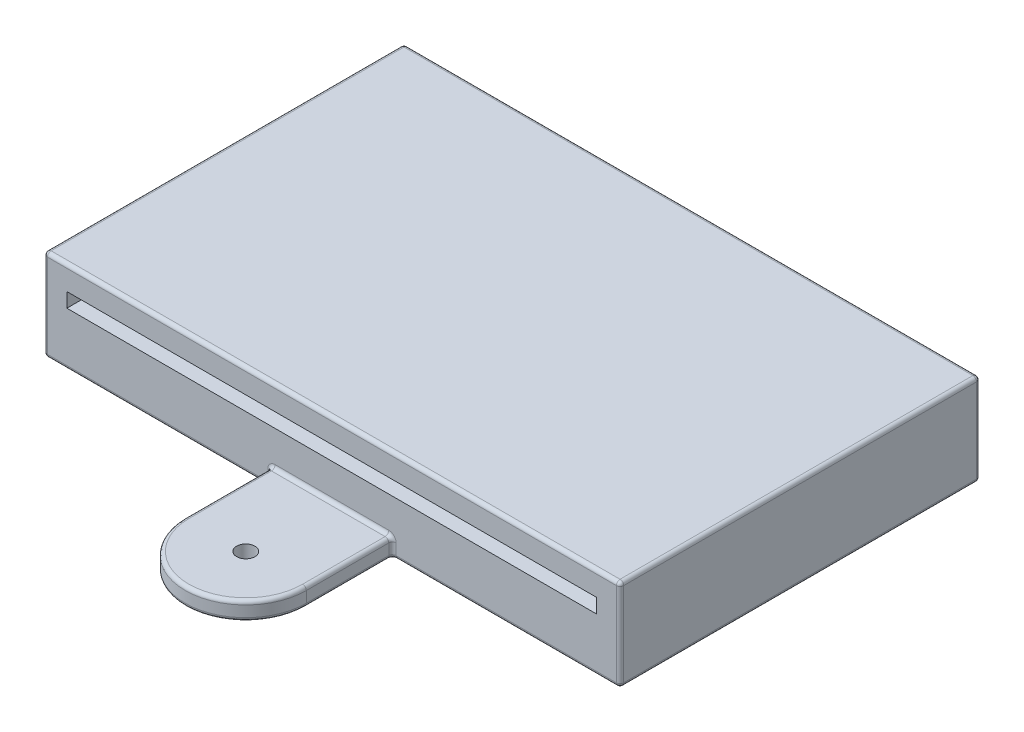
ISO-10303-21;
HEADER;
FILE_DESCRIPTION(('STEP AP214'),'2;1');
FILE_NAME('part.step','',(''),(''),'','','');
FILE_SCHEMA(('AUTOMOTIVE_DESIGN { 1 0 10303 214 1 1 1 1 }'));
ENDSEC;
DATA;
#1=APPLICATION_CONTEXT('core data for automotive mechanical design processes');
#2=APPLICATION_PROTOCOL_DEFINITION('international standard','automotive_design',2000,#1);
#3=PRODUCT_CONTEXT('',#1,'mechanical');
#4=PRODUCT('Part','Part','',(#3));
#5=PRODUCT_RELATED_PRODUCT_CATEGORY('part','',(#4));
#6=PRODUCT_DEFINITION_FORMATION('','',#4);
#7=PRODUCT_DEFINITION_CONTEXT('part definition',#1,'design');
#8=PRODUCT_DEFINITION('design','',#6,#7);
#9=PRODUCT_DEFINITION_SHAPE('','',#8);
#10=(LENGTH_UNIT() NAMED_UNIT(*) SI_UNIT(.MILLI.,.METRE.));
#11=(NAMED_UNIT(*) PLANE_ANGLE_UNIT() SI_UNIT($,.RADIAN.));
#12=(NAMED_UNIT(*) SI_UNIT($,.STERADIAN.) SOLID_ANGLE_UNIT());
#13=UNCERTAINTY_MEASURE_WITH_UNIT(LENGTH_MEASURE(1.E-05),#10,'distance_accuracy_value','');
#14=(GEOMETRIC_REPRESENTATION_CONTEXT(3) GLOBAL_UNCERTAINTY_ASSIGNED_CONTEXT((#13)) GLOBAL_UNIT_ASSIGNED_CONTEXT((#10,
#11,#12)) REPRESENTATION_CONTEXT('',''));
#15=CARTESIAN_POINT('',(0.,0.,0.));
#16=DIRECTION('',(0.,0.,1.));
#17=DIRECTION('',(1.,0.,0.));
#18=AXIS2_PLACEMENT_3D('',#15,#16,#17);
#19=CARTESIAN_POINT('',(-400.,127.,250.));
#20=DIRECTION('',(0.,0.,-1.));
#21=DIRECTION('',(-1.,0.,0.));
#22=AXIS2_PLACEMENT_3D('',#19,#20,#21);
#23=PLANE('',#22);
#24=DIRECTION('',(0.,-1.,0.));
#25=VECTOR('',#24,1.);
#26=CARTESIAN_POINT('',(89.0769273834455,127.,250.));
#27=LINE('',#26,#25);
#28=CARTESIAN_POINT('',(89.0769273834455,20.32,250.));
#29=VERTEX_POINT('',#28);
#30=CARTESIAN_POINT('',(89.0769273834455,5.08,250.));
#31=VERTEX_POINT('',#30);
#32=EDGE_CURVE('E287',#29,#31,#27,.T.);
#33=ORIENTED_EDGE('',*,*,#32,.T.);
#34=DIRECTION('',(1.,0.,0.));
#35=VECTOR('',#34,1.);
#36=CARTESIAN_POINT('',(400.,5.08,250.));
#37=LINE('',#36,#35);
#38=CARTESIAN_POINT('',(394.92,5.08,250.));
#39=VERTEX_POINT('',#38);
#40=EDGE_CURVE('E290',#31,#39,#37,.T.);
#41=ORIENTED_EDGE('',*,*,#40,.T.);
#42=DIRECTION('',(0.,-1.,0.));
#43=VECTOR('',#42,1.);
#44=CARTESIAN_POINT('',(394.92,127.,250.));
#45=LINE('',#44,#43);
#46=CARTESIAN_POINT('',(394.92,121.92,250.));
#47=VERTEX_POINT('',#46);
#48=EDGE_CURVE('E282',#39,#47,#45,.F.);
#49=ORIENTED_EDGE('',*,*,#48,.T.);
#50=DIRECTION('',(1.,0.,0.));
#51=VECTOR('',#50,1.);
#52=CARTESIAN_POINT('',(-400.,121.92,250.));
#53=LINE('',#52,#51);
#54=CARTESIAN_POINT('',(-394.92,121.92,250.));
#55=VERTEX_POINT('',#54);
#56=EDGE_CURVE('E278',#47,#55,#53,.F.);
#57=ORIENTED_EDGE('',*,*,#56,.T.);
#58=DIRECTION('',(0.,-1.,0.));
#59=VECTOR('',#58,1.);
#60=CARTESIAN_POINT('',(-394.92,127.,250.));
#61=LINE('',#60,#59);
#62=CARTESIAN_POINT('',(-394.92,5.08,250.));
#63=VERTEX_POINT('',#62);
#64=EDGE_CURVE('E276',#55,#63,#61,.T.);
#65=ORIENTED_EDGE('',*,*,#64,.T.);
#66=DIRECTION('',(1.,0.,0.));
#67=VECTOR('',#66,1.);
#68=CARTESIAN_POINT('',(-83.9969273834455,5.08,250.));
#69=LINE('',#68,#67);
#70=CARTESIAN_POINT('',(-89.0769273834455,5.08,250.));
#71=VERTEX_POINT('',#70);
#72=EDGE_CURVE('E274',#63,#71,#69,.T.);
#73=ORIENTED_EDGE('',*,*,#72,.T.);
#74=DIRECTION('',(0.,-1.,0.));
#75=VECTOR('',#74,1.);
#76=CARTESIAN_POINT('',(-89.0769273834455,127.,250.));
#77=LINE('',#76,#75);
#78=CARTESIAN_POINT('',(-89.0769273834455,20.32,250.));
#79=VERTEX_POINT('',#78);
#80=EDGE_CURVE('E272',#71,#79,#77,.F.);
#81=ORIENTED_EDGE('',*,*,#80,.T.);
#82=CARTESIAN_POINT('',(-78.9169273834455,20.32,250.));
#83=DIRECTION('',(0.,0.,-1.));
#84=DIRECTION('',(-1.,0.,0.));
#85=AXIS2_PLACEMENT_3D('',#82,#83,#84);
#86=CIRCLE('',#85,10.16);
#87=CARTESIAN_POINT('',(-78.9169273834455,30.48,250.));
#88=VERTEX_POINT('',#87);
#89=EDGE_CURVE('E264',#88,#79,#86,.F.);
#90=ORIENTED_EDGE('',*,*,#89,.F.);
#91=DIRECTION('',(1.,0.,0.));
#92=VECTOR('',#91,1.);
#93=CARTESIAN_POINT('',(-400.,30.48,250.));
#94=LINE('',#93,#92);
#95=CARTESIAN_POINT('',(78.9169273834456,30.48,250.));
#96=VERTEX_POINT('',#95);
#97=EDGE_CURVE('E280',#88,#96,#94,.T.);
#98=ORIENTED_EDGE('',*,*,#97,.T.);
#99=CARTESIAN_POINT('',(78.9169273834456,20.32,250.));
#100=DIRECTION('',(0.,0.,-1.));
#101=DIRECTION('',(-1.,0.,0.));
#102=AXIS2_PLACEMENT_3D('',#99,#100,#101);
#103=CIRCLE('',#102,10.16);
#104=EDGE_CURVE('E284',#29,#96,#103,.F.);
#105=ORIENTED_EDGE('',*,*,#104,.F.);
#106=EDGE_LOOP('',(#33,#41,#49,#57,#65,#73,#81,#90,#98,#105));
#107=FACE_BOUND('',#106,.T.);
#108=DIRECTION('',(1.,0.,0.));
#109=VECTOR('',#108,1.);
#110=CARTESIAN_POINT('',(-368.,74.,250.));
#111=LINE('',#110,#109);
#112=CARTESIAN_POINT('',(-368.,74.,250.));
#113=VERTEX_POINT('',#112);
#114=CARTESIAN_POINT('',(367.,74.,250.));
#115=VERTEX_POINT('',#114);
#116=EDGE_CURVE('E251',#113,#115,#111,.T.);
#117=ORIENTED_EDGE('',*,*,#116,.F.);
#118=DIRECTION('',(0.,-1.,0.));
#119=VECTOR('',#118,1.);
#120=CARTESIAN_POINT('',(-368.,94.,250.));
#121=LINE('',#120,#119);
#122=CARTESIAN_POINT('',(-368.,94.,250.));
#123=VERTEX_POINT('',#122);
#124=EDGE_CURVE('E225',#123,#113,#121,.T.);
#125=ORIENTED_EDGE('',*,*,#124,.F.);
#126=DIRECTION('',(-1.,0.,0.));
#127=VECTOR('',#126,1.);
#128=CARTESIAN_POINT('',(-368.,94.,250.));
#129=LINE('',#128,#127);
#130=CARTESIAN_POINT('',(367.,94.,250.));
#131=VERTEX_POINT('',#130);
#132=EDGE_CURVE('E242',#131,#123,#129,.T.);
#133=ORIENTED_EDGE('',*,*,#132,.F.);
#134=DIRECTION('',(0.,1.,0.));
#135=VECTOR('',#134,1.);
#136=CARTESIAN_POINT('',(367.,94.,250.));
#137=LINE('',#136,#135);
#138=EDGE_CURVE('E245',#115,#131,#137,.T.);
#139=ORIENTED_EDGE('',*,*,#138,.F.);
#140=EDGE_LOOP('',(#117,#125,#133,#139));
#141=FACE_BOUND('',#140,.T.);
#142=ADVANCED_FACE('F33',(#107,#141),#23,.F.);
#143=CARTESIAN_POINT('',(-400.,127.,250.));
#144=DIRECTION('',(1.,0.,0.));
#145=DIRECTION('',(0.,0.,-1.));
#146=AXIS2_PLACEMENT_3D('',#143,#144,#145);
#147=PLANE('',#146);
#148=DIRECTION('',(0.,0.,1.));
#149=VECTOR('',#148,1.);
#150=CARTESIAN_POINT('',(-400.,121.92,250.));
#151=LINE('',#150,#149);
#152=CARTESIAN_POINT('',(-400.,121.92,244.92));
#153=VERTEX_POINT('',#152);
#154=CARTESIAN_POINT('',(-400.,121.92,-244.92));
#155=VERTEX_POINT('',#154);
#156=EDGE_CURVE('E345',#153,#155,#151,.F.);
#157=ORIENTED_EDGE('',*,*,#156,.T.);
#158=DIRECTION('',(0.,-1.,0.));
#159=VECTOR('',#158,1.);
#160=CARTESIAN_POINT('',(-400.,127.,-244.92));
#161=LINE('',#160,#159);
#162=CARTESIAN_POINT('',(-400.,5.08,-244.92));
#163=VERTEX_POINT('',#162);
#164=EDGE_CURVE('E347',#155,#163,#161,.T.);
#165=ORIENTED_EDGE('',*,*,#164,.T.);
#166=DIRECTION('',(0.,0.,1.));
#167=VECTOR('',#166,1.);
#168=CARTESIAN_POINT('',(-400.,5.08,250.));
#169=LINE('',#168,#167);
#170=CARTESIAN_POINT('',(-400.,5.08,244.92));
#171=VERTEX_POINT('',#170);
#172=EDGE_CURVE('E341',#163,#171,#169,.T.);
#173=ORIENTED_EDGE('',*,*,#172,.T.);
#174=DIRECTION('',(0.,-1.,0.));
#175=VECTOR('',#174,1.);
#176=CARTESIAN_POINT('',(-400.,127.,244.92));
#177=LINE('',#176,#175);
#178=EDGE_CURVE('E343',#171,#153,#177,.F.);
#179=ORIENTED_EDGE('',*,*,#178,.T.);
#180=EDGE_LOOP('',(#157,#165,#173,#179));
#181=FACE_BOUND('',#180,.T.);
#182=ADVANCED_FACE('F506',(#181),#147,.F.);
#183=CARTESIAN_POINT('',(400.,127.,250.));
#184=DIRECTION('',(-1.,0.,0.));
#185=DIRECTION('',(0.,0.,1.));
#186=AXIS2_PLACEMENT_3D('',#183,#184,#185);
#187=PLANE('',#186);
#188=DIRECTION('',(0.,0.,-1.));
#189=VECTOR('',#188,1.);
#190=CARTESIAN_POINT('',(400.,121.92,250.));
#191=LINE('',#190,#189);
#192=CARTESIAN_POINT('',(400.,121.92,-244.92));
#193=VERTEX_POINT('',#192);
#194=CARTESIAN_POINT('',(400.,121.92,244.92));
#195=VERTEX_POINT('',#194);
#196=EDGE_CURVE('E336',#193,#195,#191,.F.);
#197=ORIENTED_EDGE('',*,*,#196,.T.);
#198=DIRECTION('',(0.,-1.,0.));
#199=VECTOR('',#198,1.);
#200=CARTESIAN_POINT('',(400.,127.,244.92));
#201=LINE('',#200,#199);
#202=CARTESIAN_POINT('',(400.,5.08,244.92));
#203=VERTEX_POINT('',#202);
#204=EDGE_CURVE('E338',#195,#203,#201,.T.);
#205=ORIENTED_EDGE('',*,*,#204,.T.);
#206=DIRECTION('',(0.,0.,-1.));
#207=VECTOR('',#206,1.);
#208=CARTESIAN_POINT('',(400.,5.08,-250.));
#209=LINE('',#208,#207);
#210=CARTESIAN_POINT('',(400.,5.08,-244.92));
#211=VERTEX_POINT('',#210);
#212=EDGE_CURVE('E332',#203,#211,#209,.T.);
#213=ORIENTED_EDGE('',*,*,#212,.T.);
#214=DIRECTION('',(0.,-1.,0.));
#215=VECTOR('',#214,1.);
#216=CARTESIAN_POINT('',(400.,127.,-244.92));
#217=LINE('',#216,#215);
#218=EDGE_CURVE('E334',#211,#193,#217,.F.);
#219=ORIENTED_EDGE('',*,*,#218,.T.);
#220=EDGE_LOOP('',(#197,#205,#213,#219));
#221=FACE_BOUND('',#220,.T.);
#222=ADVANCED_FACE('F553',(#221),#187,.F.);
#223=CARTESIAN_POINT('',(-400.,127.,-250.));
#224=DIRECTION('',(0.,0.,1.));
#225=DIRECTION('',(1.,0.,0.));
#226=AXIS2_PLACEMENT_3D('',#223,#224,#225);
#227=PLANE('',#226);
#228=DIRECTION('',(0.,-1.,0.));
#229=VECTOR('',#228,1.);
#230=CARTESIAN_POINT('',(-394.92,127.,-250.));
#231=LINE('',#230,#229);
#232=CARTESIAN_POINT('',(-394.92,5.08,-250.));
#233=VERTEX_POINT('',#232);
#234=CARTESIAN_POINT('',(-394.92,121.92,-250.));
#235=VERTEX_POINT('',#234);
#236=EDGE_CURVE('E325',#233,#235,#231,.F.);
#237=ORIENTED_EDGE('',*,*,#236,.T.);
#238=DIRECTION('',(-1.,0.,0.));
#239=VECTOR('',#238,1.);
#240=CARTESIAN_POINT('',(-400.,121.92,-250.));
#241=LINE('',#240,#239);
#242=CARTESIAN_POINT('',(394.92,121.92,-250.));
#243=VERTEX_POINT('',#242);
#244=EDGE_CURVE('E329',#235,#243,#241,.F.);
#245=ORIENTED_EDGE('',*,*,#244,.T.);
#246=DIRECTION('',(0.,-1.,0.));
#247=VECTOR('',#246,1.);
#248=CARTESIAN_POINT('',(394.92,127.,-250.));
#249=LINE('',#248,#247);
#250=CARTESIAN_POINT('',(394.92,5.08,-250.));
#251=VERTEX_POINT('',#250);
#252=EDGE_CURVE('E327',#243,#251,#249,.T.);
#253=ORIENTED_EDGE('',*,*,#252,.T.);
#254=DIRECTION('',(-1.,0.,0.));
#255=VECTOR('',#254,1.);
#256=CARTESIAN_POINT('',(-400.,5.08,-250.));
#257=LINE('',#256,#255);
#258=EDGE_CURVE('E323',#251,#233,#257,.T.);
#259=ORIENTED_EDGE('',*,*,#258,.T.);
#260=EDGE_LOOP('',(#237,#245,#253,#259));
#261=FACE_BOUND('',#260,.T.);
#262=ADVANCED_FACE('F562',(#261),#227,.F.);
#263=CARTESIAN_POINT('',(-400.,127.,-250.));
#264=DIRECTION('',(0.,-1.,0.));
#265=DIRECTION('',(0.,0.,-1.));
#266=AXIS2_PLACEMENT_3D('',#263,#264,#265);
#267=PLANE('',#266);
#268=DIRECTION('',(1.,0.,0.));
#269=VECTOR('',#268,1.);
#270=CARTESIAN_POINT('',(-400.,127.,244.92));
#271=LINE('',#270,#269);
#272=CARTESIAN_POINT('',(-394.92,127.,244.92));
#273=VERTEX_POINT('',#272);
#274=CARTESIAN_POINT('',(394.92,127.,244.92));
#275=VERTEX_POINT('',#274);
#276=EDGE_CURVE('E318',#273,#275,#271,.T.);
#277=ORIENTED_EDGE('',*,*,#276,.T.);
#278=DIRECTION('',(0.,0.,-1.));
#279=VECTOR('',#278,1.);
#280=CARTESIAN_POINT('',(394.92,127.,-250.));
#281=LINE('',#280,#279);
#282=CARTESIAN_POINT('',(394.92,127.,-244.92));
#283=VERTEX_POINT('',#282);
#284=EDGE_CURVE('E321',#275,#283,#281,.T.);
#285=ORIENTED_EDGE('',*,*,#284,.T.);
#286=DIRECTION('',(-1.,0.,0.));
#287=VECTOR('',#286,1.);
#288=CARTESIAN_POINT('',(-400.,127.,-244.92));
#289=LINE('',#288,#287);
#290=CARTESIAN_POINT('',(-394.92,127.,-244.92));
#291=VERTEX_POINT('',#290);
#292=EDGE_CURVE('E316',#283,#291,#289,.T.);
#293=ORIENTED_EDGE('',*,*,#292,.T.);
#294=DIRECTION('',(0.,0.,1.));
#295=VECTOR('',#294,1.);
#296=CARTESIAN_POINT('',(-394.92,127.,-250.));
#297=LINE('',#296,#295);
#298=EDGE_CURVE('E314',#291,#273,#297,.T.);
#299=ORIENTED_EDGE('',*,*,#298,.T.);
#300=EDGE_LOOP('',(#277,#285,#293,#299));
#301=FACE_BOUND('',#300,.T.);
#302=ADVANCED_FACE('F540',(#301),#267,.F.);
#303=CARTESIAN_POINT('',(-400.,0.,-250.));
#304=DIRECTION('',(0.,-1.,0.));
#305=DIRECTION('',(0.,0.,-1.));
#306=AXIS2_PLACEMENT_3D('',#303,#304,#305);
#307=PLANE('',#306);
#308=CARTESIAN_POINT('',(0.,0.,369.634));
#309=DIRECTION('',(0.,-1.,0.));
#310=DIRECTION('',(0.,0.,-1.));
#311=AXIS2_PLACEMENT_3D('',#308,#309,#310);
#312=CIRCLE('',#311,78.9169273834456);
#313=CARTESIAN_POINT('',(78.9169273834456,0.,369.634));
#314=VERTEX_POINT('',#313);
#315=CARTESIAN_POINT('',(-78.9169273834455,0.,369.634));
#316=VERTEX_POINT('',#315);
#317=EDGE_CURVE('E55',#314,#316,#312,.T.);
#318=ORIENTED_EDGE('',*,*,#317,.T.);
#319=DIRECTION('',(0.,0.,-1.));
#320=VECTOR('',#319,1.);
#321=CARTESIAN_POINT('',(-78.9169273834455,0.,-250.));
#322=LINE('',#321,#320);
#323=CARTESIAN_POINT('',(-78.9169273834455,0.,255.08));
#324=VERTEX_POINT('',#323);
#325=EDGE_CURVE('E50',#316,#324,#322,.T.);
#326=ORIENTED_EDGE('',*,*,#325,.T.);
#327=CARTESIAN_POINT('',(-89.0769273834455,0.,255.08));
#328=DIRECTION('',(0.,-1.,0.));
#329=DIRECTION('',(0.,0.,-1.));
#330=AXIS2_PLACEMENT_3D('',#327,#328,#329);
#331=CIRCLE('',#330,10.16);
#332=CARTESIAN_POINT('',(-89.0769273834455,0.,244.92));
#333=VERTEX_POINT('',#332);
#334=EDGE_CURVE('E370',#333,#324,#331,.T.);
#335=ORIENTED_EDGE('',*,*,#334,.F.);
#336=DIRECTION('',(1.,0.,0.));
#337=VECTOR('',#336,1.);
#338=CARTESIAN_POINT('',(-400.,0.,244.92));
#339=LINE('',#338,#337);
#340=CARTESIAN_POINT('',(-394.92,0.,244.92));
#341=VERTEX_POINT('',#340);
#342=EDGE_CURVE('E361',#333,#341,#339,.F.);
#343=ORIENTED_EDGE('',*,*,#342,.T.);
#344=DIRECTION('',(0.,0.,1.));
#345=VECTOR('',#344,1.);
#346=CARTESIAN_POINT('',(-394.92,0.,-250.));
#347=LINE('',#346,#345);
#348=CARTESIAN_POINT('',(-394.92,0.,-244.92));
#349=VERTEX_POINT('',#348);
#350=EDGE_CURVE('E353',#341,#349,#347,.F.);
#351=ORIENTED_EDGE('',*,*,#350,.T.);
#352=DIRECTION('',(-1.,0.,0.));
#353=VECTOR('',#352,1.);
#354=CARTESIAN_POINT('',(400.,0.,-244.92));
#355=LINE('',#354,#353);
#356=CARTESIAN_POINT('',(394.92,0.,-244.92));
#357=VERTEX_POINT('',#356);
#358=EDGE_CURVE('E355',#349,#357,#355,.F.);
#359=ORIENTED_EDGE('',*,*,#358,.T.);
#360=DIRECTION('',(0.,0.,-1.));
#361=VECTOR('',#360,1.);
#362=CARTESIAN_POINT('',(394.92,0.,250.));
#363=LINE('',#362,#361);
#364=CARTESIAN_POINT('',(394.92,0.,244.92));
#365=VERTEX_POINT('',#364);
#366=EDGE_CURVE('E357',#357,#365,#363,.F.);
#367=ORIENTED_EDGE('',*,*,#366,.T.);
#368=DIRECTION('',(1.,0.,0.));
#369=VECTOR('',#368,1.);
#370=CARTESIAN_POINT('',(83.9969273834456,0.,244.92));
#371=LINE('',#370,#369);
#372=CARTESIAN_POINT('',(89.0769273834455,0.,244.92));
#373=VERTEX_POINT('',#372);
#374=EDGE_CURVE('E359',#365,#373,#371,.F.);
#375=ORIENTED_EDGE('',*,*,#374,.T.);
#376=CARTESIAN_POINT('',(89.0769273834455,0.,255.08));
#377=DIRECTION('',(0.,-1.,0.));
#378=DIRECTION('',(0.,0.,-1.));
#379=AXIS2_PLACEMENT_3D('',#376,#377,#378);
#380=CIRCLE('',#379,10.16);
#381=CARTESIAN_POINT('',(78.9169273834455,0.,255.08));
#382=VERTEX_POINT('',#381);
#383=EDGE_CURVE('E364',#382,#373,#380,.T.);
#384=ORIENTED_EDGE('',*,*,#383,.F.);
#385=DIRECTION('',(0.,0.,1.));
#386=VECTOR('',#385,1.);
#387=CARTESIAN_POINT('',(78.9169273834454,0.,-250.));
#388=LINE('',#387,#386);
#389=EDGE_CURVE('E367',#382,#314,#388,.T.);
#390=ORIENTED_EDGE('',*,*,#389,.T.);
#391=EDGE_LOOP('',(#318,#326,#335,#343,#351,#359,#367,#375,#384,#390));
#392=FACE_BOUND('',#391,.T.);
#393=CARTESIAN_POINT('',(0.,0.,369.634));
#394=DIRECTION('',(0.,-1.,0.));
#395=DIRECTION('',(0.,0.,-1.));
#396=AXIS2_PLACEMENT_3D('',#393,#394,#395);
#397=CIRCLE('',#396,17.78);
#398=CARTESIAN_POINT('',(0.,0.,351.854));
#399=VERTEX_POINT('',#398);
#400=EDGE_CURVE('E350',#399,#399,#397,.F.);
#401=ORIENTED_EDGE('',*,*,#400,.T.);
#402=EDGE_LOOP('',(#401));
#403=FACE_BOUND('',#402,.T.);
#404=ADVANCED_FACE('F974',(#392,#403),#307,.T.);
#405=CARTESIAN_POINT('',(-83.9969273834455,25.4,250.));
#406=DIRECTION('',(-1.,0.,0.));
#407=DIRECTION('',(0.,0.,1.));
#408=AXIS2_PLACEMENT_3D('',#405,#406,#407);
#409=PLANE('',#408);
#410=DIRECTION('',(0.,-1.,0.));
#411=VECTOR('',#410,1.);
#412=CARTESIAN_POINT('',(-83.9969273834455,25.4,369.634));
#413=LINE('',#412,#411);
#414=CARTESIAN_POINT('',(-83.9969273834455,20.32,369.634));
#415=VERTEX_POINT('',#414);
#416=CARTESIAN_POINT('',(-83.9969273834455,5.08,369.634));
#417=VERTEX_POINT('',#416);
#418=EDGE_CURVE('E261',#415,#417,#413,.T.);
#419=ORIENTED_EDGE('',*,*,#418,.F.);
#420=DIRECTION('',(0.,0.,-1.));
#421=VECTOR('',#420,1.);
#422=CARTESIAN_POINT('',(-83.9969273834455,20.32,250.));
#423=LINE('',#422,#421);
#424=CARTESIAN_POINT('',(-83.9969273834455,20.32,255.08));
#425=VERTEX_POINT('',#424);
#426=EDGE_CURVE('E312',#415,#425,#423,.T.);
#427=ORIENTED_EDGE('',*,*,#426,.T.);
#428=DIRECTION('',(0.,-1.,0.));
#429=VECTOR('',#428,1.);
#430=CARTESIAN_POINT('',(-83.9969273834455,25.4,255.08));
#431=LINE('',#430,#429);
#432=CARTESIAN_POINT('',(-83.9969273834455,5.08,255.08));
#433=VERTEX_POINT('',#432);
#434=EDGE_CURVE('E308',#425,#433,#431,.T.);
#435=ORIENTED_EDGE('',*,*,#434,.T.);
#436=DIRECTION('',(0.,0.,-1.));
#437=VECTOR('',#436,1.);
#438=CARTESIAN_POINT('',(-83.9969273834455,5.08,250.));
#439=LINE('',#438,#437);
#440=EDGE_CURVE('E310',#433,#417,#439,.F.);
#441=ORIENTED_EDGE('',*,*,#440,.T.);
#442=EDGE_LOOP('',(#419,#427,#435,#441));
#443=FACE_BOUND('',#442,.T.);
#444=ADVANCED_FACE('F965',(#443),#409,.T.);
#445=CARTESIAN_POINT('',(0.,25.4,369.634));
#446=DIRECTION('',(0.,-1.,0.));
#447=DIRECTION('',(0.,0.,-1.));
#448=AXIS2_PLACEMENT_3D('',#445,#446,#447);
#449=CYLINDRICAL_SURFACE('',#448,83.9969273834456);
#450=ORIENTED_EDGE('',*,*,#418,.T.);
#451=CARTESIAN_POINT('',(0.,5.08,369.634));
#452=DIRECTION('',(0.,-1.,0.));
#453=DIRECTION('',(0.,0.,-1.));
#454=AXIS2_PLACEMENT_3D('',#451,#452,#453);
#455=CIRCLE('',#454,83.9969273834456);
#456=CARTESIAN_POINT('',(83.9969273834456,5.08,369.634));
#457=VERTEX_POINT('',#456);
#458=EDGE_CURVE('E42',#417,#457,#455,.F.);
#459=ORIENTED_EDGE('',*,*,#458,.T.);
#460=DIRECTION('',(0.,-1.,0.));
#461=VECTOR('',#460,1.);
#462=CARTESIAN_POINT('',(83.9969273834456,25.4,369.634));
#463=LINE('',#462,#461);
#464=CARTESIAN_POINT('',(83.9969273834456,20.32,369.634));
#465=VERTEX_POINT('',#464);
#466=EDGE_CURVE('E265',#465,#457,#463,.T.);
#467=ORIENTED_EDGE('',*,*,#466,.F.);
#468=CARTESIAN_POINT('',(0.,20.32,369.634));
#469=DIRECTION('',(0.,1.,0.));
#470=DIRECTION('',(0.,0.,1.));
#471=AXIS2_PLACEMENT_3D('',#468,#469,#470);
#472=CIRCLE('',#471,83.9969273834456);
#473=EDGE_CURVE('E373',#465,#415,#472,.F.);
#474=ORIENTED_EDGE('',*,*,#473,.T.);
#475=EDGE_LOOP('',(#450,#459,#467,#474));
#476=FACE_BOUND('',#475,.T.);
#477=ADVANCED_FACE('F956',(#476),#449,.T.);
#478=CARTESIAN_POINT('',(83.9969273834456,25.4,369.634));
#479=DIRECTION('',(1.,0.,0.));
#480=DIRECTION('',(0.,0.,-1.));
#481=AXIS2_PLACEMENT_3D('',#478,#479,#480);
#482=PLANE('',#481);
#483=DIRECTION('',(0.,-1.,0.));
#484=VECTOR('',#483,1.);
#485=CARTESIAN_POINT('',(83.9969273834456,25.4,255.08));
#486=LINE('',#485,#484);
#487=CARTESIAN_POINT('',(83.9969273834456,5.08,255.08));
#488=VERTEX_POINT('',#487);
#489=CARTESIAN_POINT('',(83.9969273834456,20.32,255.08));
#490=VERTEX_POINT('',#489);
#491=EDGE_CURVE('E294',#488,#490,#486,.F.);
#492=ORIENTED_EDGE('',*,*,#491,.T.);
#493=DIRECTION('',(0.,0.,1.));
#494=VECTOR('',#493,1.);
#495=CARTESIAN_POINT('',(83.9969273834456,20.32,369.634));
#496=LINE('',#495,#494);
#497=EDGE_CURVE('E297',#490,#465,#496,.T.);
#498=ORIENTED_EDGE('',*,*,#497,.T.);
#499=ORIENTED_EDGE('',*,*,#466,.T.);
#500=DIRECTION('',(0.,0.,1.));
#501=VECTOR('',#500,1.);
#502=CARTESIAN_POINT('',(83.9969273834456,5.08,369.634));
#503=LINE('',#502,#501);
#504=EDGE_CURVE('E292',#457,#488,#503,.F.);
#505=ORIENTED_EDGE('',*,*,#504,.T.);
#506=EDGE_LOOP('',(#492,#498,#499,#505));
#507=FACE_BOUND('',#506,.T.);
#508=ADVANCED_FACE('F947',(#507),#482,.T.);
#509=CARTESIAN_POINT('',(0.,25.4,369.634));
#510=DIRECTION('',(0.,1.,0.));
#511=DIRECTION('',(0.,0.,1.));
#512=AXIS2_PLACEMENT_3D('',#509,#510,#511);
#513=PLANE('',#512);
#514=DIRECTION('',(0.,0.,1.));
#515=VECTOR('',#514,1.);
#516=CARTESIAN_POINT('',(78.9169273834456,25.4,369.634));
#517=LINE('',#516,#515);
#518=CARTESIAN_POINT('',(78.9169273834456,25.4,369.634));
#519=VERTEX_POINT('',#518);
#520=CARTESIAN_POINT('',(78.9169273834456,25.4,255.08));
#521=VERTEX_POINT('',#520);
#522=EDGE_CURVE('E303',#519,#521,#517,.F.);
#523=ORIENTED_EDGE('',*,*,#522,.T.);
#524=DIRECTION('',(1.,0.,0.));
#525=VECTOR('',#524,1.);
#526=CARTESIAN_POINT('',(0.,25.4,255.08));
#527=LINE('',#526,#525);
#528=CARTESIAN_POINT('',(-78.9169273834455,25.4,255.08));
#529=VERTEX_POINT('',#528);
#530=EDGE_CURVE('E305',#521,#529,#527,.F.);
#531=ORIENTED_EDGE('',*,*,#530,.T.);
#532=DIRECTION('',(0.,0.,-1.));
#533=VECTOR('',#532,1.);
#534=CARTESIAN_POINT('',(-78.9169273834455,25.4,369.634));
#535=LINE('',#534,#533);
#536=CARTESIAN_POINT('',(-78.9169273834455,25.4,369.634));
#537=VERTEX_POINT('',#536);
#538=EDGE_CURVE('E301',#529,#537,#535,.F.);
#539=ORIENTED_EDGE('',*,*,#538,.T.);
#540=CARTESIAN_POINT('',(0.,25.4,369.634));
#541=DIRECTION('',(0.,1.,0.));
#542=DIRECTION('',(0.,0.,1.));
#543=AXIS2_PLACEMENT_3D('',#540,#541,#542);
#544=CIRCLE('',#543,78.9169273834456);
#545=EDGE_CURVE('E299',#537,#519,#544,.T.);
#546=ORIENTED_EDGE('',*,*,#545,.T.);
#547=EDGE_LOOP('',(#523,#531,#539,#546));
#548=FACE_BOUND('',#547,.T.);
#549=CARTESIAN_POINT('',(0.,25.4,369.634));
#550=DIRECTION('',(0.,1.,0.));
#551=DIRECTION('',(0.,0.,1.));
#552=AXIS2_PLACEMENT_3D('',#549,#550,#551);
#553=CIRCLE('',#552,12.7);
#554=CARTESIAN_POINT('',(0.,25.4,382.334));
#555=VERTEX_POINT('',#554);
#556=EDGE_CURVE('E257',#555,#555,#553,.T.);
#557=ORIENTED_EDGE('',*,*,#556,.F.);
#558=EDGE_LOOP('',(#557));
#559=FACE_BOUND('',#558,.T.);
#560=ADVANCED_FACE('F938',(#548,#559),#513,.T.);
#561=CARTESIAN_POINT('',(0.,127.,369.634));
#562=DIRECTION('',(0.,-1.,0.));
#563=DIRECTION('',(0.,0.,-1.));
#564=AXIS2_PLACEMENT_3D('',#561,#562,#563);
#565=CYLINDRICAL_SURFACE('',#564,12.7);
#566=CARTESIAN_POINT('',(0.,5.08,369.634));
#567=DIRECTION('',(0.,-1.,0.));
#568=DIRECTION('',(0.,0.,-1.));
#569=AXIS2_PLACEMENT_3D('',#566,#567,#568);
#570=CIRCLE('',#569,12.7);
#571=CARTESIAN_POINT('',(0.,5.08,356.934));
#572=VERTEX_POINT('',#571);
#573=EDGE_CURVE('E11',#572,#572,#570,.T.);
#574=ORIENTED_EDGE('',*,*,#573,.T.);
#575=EDGE_LOOP('',(#574));
#576=FACE_BOUND('',#575,.T.);
#577=ORIENTED_EDGE('',*,*,#556,.T.);
#578=EDGE_LOOP('',(#577));
#579=FACE_BOUND('',#578,.T.);
#580=ADVANCED_FACE('F931',(#576,#579),#565,.F.);
#581=CARTESIAN_POINT('',(-368.,94.,173.8));
#582=DIRECTION('',(-1.,0.,0.));
#583=DIRECTION('',(0.,0.,1.));
#584=AXIS2_PLACEMENT_3D('',#581,#582,#583);
#585=PLANE('',#584);
#586=ORIENTED_EDGE('',*,*,#124,.T.);
#587=DIRECTION('',(0.,0.,1.));
#588=VECTOR('',#587,1.);
#589=CARTESIAN_POINT('',(-368.,74.,173.8));
#590=LINE('',#589,#588);
#591=CARTESIAN_POINT('',(-368.,74.,173.8));
#592=VERTEX_POINT('',#591);
#593=EDGE_CURVE('E218',#592,#113,#590,.T.);
#594=ORIENTED_EDGE('',*,*,#593,.F.);
#595=DIRECTION('',(0.,-1.,0.));
#596=VECTOR('',#595,1.);
#597=CARTESIAN_POINT('',(-368.,94.,173.8));
#598=LINE('',#597,#596);
#599=CARTESIAN_POINT('',(-368.,94.,173.8));
#600=VERTEX_POINT('',#599);
#601=EDGE_CURVE('E222',#600,#592,#598,.T.);
#602=ORIENTED_EDGE('',*,*,#601,.F.);
#603=DIRECTION('',(0.,0.,1.));
#604=VECTOR('',#603,1.);
#605=CARTESIAN_POINT('',(-368.,94.,173.8));
#606=LINE('',#605,#604);
#607=EDGE_CURVE('E255',#600,#123,#606,.T.);
#608=ORIENTED_EDGE('',*,*,#607,.T.);
#609=EDGE_LOOP('',(#586,#594,#602,#608));
#610=FACE_BOUND('',#609,.T.);
#611=ADVANCED_FACE('F220',(#610),#585,.F.);
#612=CARTESIAN_POINT('',(-368.,94.,173.8));
#613=DIRECTION('',(0.,1.,0.));
#614=DIRECTION('',(0.,0.,1.));
#615=AXIS2_PLACEMENT_3D('',#612,#613,#614);
#616=PLANE('',#615);
#617=ORIENTED_EDGE('',*,*,#132,.T.);
#618=ORIENTED_EDGE('',*,*,#607,.F.);
#619=DIRECTION('',(-1.,0.,0.));
#620=VECTOR('',#619,1.);
#621=CARTESIAN_POINT('',(-368.,94.,173.8));
#622=LINE('',#621,#620);
#623=CARTESIAN_POINT('',(367.,94.,173.8));
#624=VERTEX_POINT('',#623);
#625=EDGE_CURVE('E230',#624,#600,#622,.T.);
#626=ORIENTED_EDGE('',*,*,#625,.F.);
#627=DIRECTION('',(0.,0.,1.));
#628=VECTOR('',#627,1.);
#629=CARTESIAN_POINT('',(367.,94.,173.8));
#630=LINE('',#629,#628);
#631=EDGE_CURVE('E258',#624,#131,#630,.T.);
#632=ORIENTED_EDGE('',*,*,#631,.T.);
#633=EDGE_LOOP('',(#617,#618,#626,#632));
#634=FACE_BOUND('',#633,.T.);
#635=ADVANCED_FACE('F914',(#634),#616,.F.);
#636=CARTESIAN_POINT('',(367.,94.,173.8));
#637=DIRECTION('',(1.,0.,0.));
#638=DIRECTION('',(0.,0.,-1.));
#639=AXIS2_PLACEMENT_3D('',#636,#637,#638);
#640=PLANE('',#639);
#641=ORIENTED_EDGE('',*,*,#138,.T.);
#642=ORIENTED_EDGE('',*,*,#631,.F.);
#643=DIRECTION('',(0.,1.,0.));
#644=VECTOR('',#643,1.);
#645=CARTESIAN_POINT('',(367.,94.,173.8));
#646=LINE('',#645,#644);
#647=CARTESIAN_POINT('',(367.,74.,173.8));
#648=VERTEX_POINT('',#647);
#649=EDGE_CURVE('E238',#648,#624,#646,.T.);
#650=ORIENTED_EDGE('',*,*,#649,.F.);
#651=DIRECTION('',(0.,0.,1.));
#652=VECTOR('',#651,1.);
#653=CARTESIAN_POINT('',(367.,74.,173.8));
#654=LINE('',#653,#652);
#655=EDGE_CURVE('E229',#648,#115,#654,.T.);
#656=ORIENTED_EDGE('',*,*,#655,.T.);
#657=EDGE_LOOP('',(#641,#642,#650,#656));
#658=FACE_BOUND('',#657,.T.);
#659=ADVANCED_FACE('F906',(#658),#640,.F.);
#660=CARTESIAN_POINT('',(-368.,74.,173.8));
#661=DIRECTION('',(0.,-1.,0.));
#662=DIRECTION('',(0.,0.,-1.));
#663=AXIS2_PLACEMENT_3D('',#660,#661,#662);
#664=PLANE('',#663);
#665=ORIENTED_EDGE('',*,*,#116,.T.);
#666=ORIENTED_EDGE('',*,*,#655,.F.);
#667=DIRECTION('',(1.,0.,0.));
#668=VECTOR('',#667,1.);
#669=CARTESIAN_POINT('',(-368.,74.,173.8));
#670=LINE('',#669,#668);
#671=EDGE_CURVE('E233',#592,#648,#670,.T.);
#672=ORIENTED_EDGE('',*,*,#671,.F.);
#673=ORIENTED_EDGE('',*,*,#593,.T.);
#674=EDGE_LOOP('',(#665,#666,#672,#673));
#675=FACE_BOUND('',#674,.T.);
#676=ADVANCED_FACE('F234',(#675),#664,.F.);
#677=CARTESIAN_POINT('',(-368.,74.,173.8));
#678=DIRECTION('',(0.,0.,1.));
#679=DIRECTION('',(1.,0.,0.));
#680=AXIS2_PLACEMENT_3D('',#677,#678,#679);
#681=PLANE('',#680);
#682=ORIENTED_EDGE('',*,*,#601,.T.);
#683=ORIENTED_EDGE('',*,*,#671,.T.);
#684=ORIENTED_EDGE('',*,*,#649,.T.);
#685=ORIENTED_EDGE('',*,*,#625,.T.);
#686=EDGE_LOOP('',(#682,#683,#684,#685));
#687=FACE_BOUND('',#686,.T.);
#688=ADVANCED_FACE('F240',(#687),#681,.T.);
#689=CARTESIAN_POINT('',(-394.92,121.92,-244.92));
#690=DIRECTION('',(0.,0.,1.));
#691=DIRECTION('',(1.,0.,0.));
#692=AXIS2_PLACEMENT_3D('',#689,#690,#691);
#693=SPHERICAL_SURFACE('',#692,5.08);
#694=CARTESIAN_POINT('',(-394.92,121.92,-244.92));
#695=DIRECTION('',(0.,1.,0.));
#696=DIRECTION('',(0.,0.,1.));
#697=AXIS2_PLACEMENT_3D('',#694,#695,#696);
#698=CIRCLE('',#697,5.08);
#699=EDGE_CURVE('E480',#155,#235,#698,.F.);
#700=ORIENTED_EDGE('',*,*,#699,.F.);
#701=CARTESIAN_POINT('',(-394.92,121.92,-244.92));
#702=DIRECTION('',(0.,0.,-1.));
#703=DIRECTION('',(-1.,0.,0.));
#704=AXIS2_PLACEMENT_3D('',#701,#702,#703);
#705=CIRCLE('',#704,5.08);
#706=EDGE_CURVE('E37',#291,#155,#705,.F.);
#707=ORIENTED_EDGE('',*,*,#706,.F.);
#708=CARTESIAN_POINT('',(-394.92,121.92,-244.92));
#709=DIRECTION('',(-1.,0.,0.));
#710=DIRECTION('',(0.,0.,1.));
#711=AXIS2_PLACEMENT_3D('',#708,#709,#710);
#712=CIRCLE('',#711,5.08);
#713=EDGE_CURVE('E482',#235,#291,#712,.F.);
#714=ORIENTED_EDGE('',*,*,#713,.F.);
#715=EDGE_LOOP('',(#700,#707,#714));
#716=FACE_BOUND('',#715,.T.);
#717=ADVANCED_FACE('F499',(#716),#693,.T.);
#718=CARTESIAN_POINT('',(-394.92,121.92,-250.));
#719=DIRECTION('',(0.,0.,1.));
#720=DIRECTION('',(1.,0.,0.));
#721=AXIS2_PLACEMENT_3D('',#718,#719,#720);
#722=CYLINDRICAL_SURFACE('',#721,5.08);
#723=ORIENTED_EDGE('',*,*,#706,.T.);
#724=ORIENTED_EDGE('',*,*,#156,.F.);
#725=CARTESIAN_POINT('',(-394.92,121.92,244.92));
#726=DIRECTION('',(0.,0.,1.));
#727=DIRECTION('',(1.,0.,0.));
#728=AXIS2_PLACEMENT_3D('',#725,#726,#727);
#729=CIRCLE('',#728,5.08);
#730=EDGE_CURVE('E474',#273,#153,#729,.T.);
#731=ORIENTED_EDGE('',*,*,#730,.F.);
#732=ORIENTED_EDGE('',*,*,#298,.F.);
#733=EDGE_LOOP('',(#723,#724,#731,#732));
#734=FACE_BOUND('',#733,.T.);
#735=ADVANCED_FACE('F494',(#734),#722,.T.);
#736=CARTESIAN_POINT('',(-400.,121.92,-244.92));
#737=DIRECTION('',(-1.,0.,0.));
#738=DIRECTION('',(0.,0.,1.));
#739=AXIS2_PLACEMENT_3D('',#736,#737,#738);
#740=CYLINDRICAL_SURFACE('',#739,5.08);
#741=ORIENTED_EDGE('',*,*,#713,.T.);
#742=ORIENTED_EDGE('',*,*,#292,.F.);
#743=CARTESIAN_POINT('',(394.92,121.92,-244.92));
#744=DIRECTION('',(1.,0.,0.));
#745=DIRECTION('',(0.,0.,-1.));
#746=AXIS2_PLACEMENT_3D('',#743,#744,#745);
#747=CIRCLE('',#746,5.08);
#748=EDGE_CURVE('E471',#243,#283,#747,.T.);
#749=ORIENTED_EDGE('',*,*,#748,.F.);
#750=ORIENTED_EDGE('',*,*,#244,.F.);
#751=EDGE_LOOP('',(#741,#742,#749,#750));
#752=FACE_BOUND('',#751,.T.);
#753=ADVANCED_FACE('F542',(#752),#740,.T.);
#754=CARTESIAN_POINT('',(-394.92,127.,-244.92));
#755=DIRECTION('',(0.,-1.,0.));
#756=DIRECTION('',(0.,0.,-1.));
#757=AXIS2_PLACEMENT_3D('',#754,#755,#756);
#758=CYLINDRICAL_SURFACE('',#757,5.08);
#759=ORIENTED_EDGE('',*,*,#699,.T.);
#760=ORIENTED_EDGE('',*,*,#236,.F.);
#761=CARTESIAN_POINT('',(-394.92,5.08,-244.92));
#762=DIRECTION('',(0.,-1.,0.));
#763=DIRECTION('',(0.,0.,-1.));
#764=AXIS2_PLACEMENT_3D('',#761,#762,#763);
#765=CIRCLE('',#764,5.08);
#766=EDGE_CURVE('E468',#163,#233,#765,.T.);
#767=ORIENTED_EDGE('',*,*,#766,.F.);
#768=ORIENTED_EDGE('',*,*,#164,.F.);
#769=EDGE_LOOP('',(#759,#760,#767,#768));
#770=FACE_BOUND('',#769,.T.);
#771=ADVANCED_FACE('F503',(#770),#758,.T.);
#772=CARTESIAN_POINT('',(-394.92,5.08,250.));
#773=DIRECTION('',(0.,0.,-1.));
#774=DIRECTION('',(-1.,0.,0.));
#775=AXIS2_PLACEMENT_3D('',#772,#773,#774);
#776=CYLINDRICAL_SURFACE('',#775,5.08);
#777=CARTESIAN_POINT('',(-394.92,5.08,244.92));
#778=DIRECTION('',(0.,0.,1.));
#779=DIRECTION('',(1.,0.,0.));
#780=AXIS2_PLACEMENT_3D('',#777,#778,#779);
#781=CIRCLE('',#780,5.08);
#782=EDGE_CURVE('E463',#171,#341,#781,.T.);
#783=ORIENTED_EDGE('',*,*,#782,.F.);
#784=ORIENTED_EDGE('',*,*,#172,.F.);
#785=CARTESIAN_POINT('',(-394.92,5.08,-244.92));
#786=DIRECTION('',(0.,0.,-1.));
#787=DIRECTION('',(-1.,0.,0.));
#788=AXIS2_PLACEMENT_3D('',#785,#786,#787);
#789=CIRCLE('',#788,5.08);
#790=EDGE_CURVE('E466',#349,#163,#789,.T.);
#791=ORIENTED_EDGE('',*,*,#790,.F.);
#792=ORIENTED_EDGE('',*,*,#350,.F.);
#793=EDGE_LOOP('',(#783,#784,#791,#792));
#794=FACE_BOUND('',#793,.T.);
#795=ADVANCED_FACE('F516',(#794),#776,.T.);
#796=CARTESIAN_POINT('',(-394.92,127.,244.92));
#797=DIRECTION('',(0.,-1.,0.));
#798=DIRECTION('',(0.,0.,-1.));
#799=AXIS2_PLACEMENT_3D('',#796,#797,#798);
#800=CYLINDRICAL_SURFACE('',#799,5.08);
#801=CARTESIAN_POINT('',(-394.92,121.92,244.92));
#802=DIRECTION('',(0.,1.,0.));
#803=DIRECTION('',(0.,0.,1.));
#804=AXIS2_PLACEMENT_3D('',#801,#802,#803);
#805=CIRCLE('',#804,5.08);
#806=EDGE_CURVE('E477',#153,#55,#805,.T.);
#807=ORIENTED_EDGE('',*,*,#806,.F.);
#808=ORIENTED_EDGE('',*,*,#178,.F.);
#809=CARTESIAN_POINT('',(-394.92,5.08,244.92));
#810=DIRECTION('',(0.,-1.,0.));
#811=DIRECTION('',(0.,0.,-1.));
#812=AXIS2_PLACEMENT_3D('',#809,#810,#811);
#813=CIRCLE('',#812,5.08);
#814=EDGE_CURVE('E460',#63,#171,#813,.T.);
#815=ORIENTED_EDGE('',*,*,#814,.F.);
#816=ORIENTED_EDGE('',*,*,#64,.F.);
#817=EDGE_LOOP('',(#807,#808,#815,#816));
#818=FACE_BOUND('',#817,.T.);
#819=ADVANCED_FACE('F511',(#818),#800,.T.);
#820=CARTESIAN_POINT('',(-394.92,121.92,244.92));
#821=DIRECTION('',(0.,0.,1.));
#822=DIRECTION('',(1.,0.,0.));
#823=AXIS2_PLACEMENT_3D('',#820,#821,#822);
#824=SPHERICAL_SURFACE('',#823,5.08);
#825=ORIENTED_EDGE('',*,*,#730,.T.);
#826=ORIENTED_EDGE('',*,*,#806,.T.);
#827=CARTESIAN_POINT('',(-394.92,121.92,244.92));
#828=DIRECTION('',(-1.,0.,0.));
#829=DIRECTION('',(0.,0.,1.));
#830=AXIS2_PLACEMENT_3D('',#827,#828,#829);
#831=CIRCLE('',#830,5.08);
#832=EDGE_CURVE('E457',#273,#55,#831,.F.);
#833=ORIENTED_EDGE('',*,*,#832,.F.);
#834=EDGE_LOOP('',(#825,#826,#833));
#835=FACE_BOUND('',#834,.T.);
#836=ADVANCED_FACE('F533',(#835),#824,.T.);
#837=CARTESIAN_POINT('',(394.92,121.92,-244.92));
#838=DIRECTION('',(0.,0.,1.));
#839=DIRECTION('',(1.,0.,0.));
#840=AXIS2_PLACEMENT_3D('',#837,#838,#839);
#841=SPHERICAL_SURFACE('',#840,5.08);
#842=CARTESIAN_POINT('',(394.92,121.92,-244.92));
#843=DIRECTION('',(0.,1.,0.));
#844=DIRECTION('',(0.,0.,1.));
#845=AXIS2_PLACEMENT_3D('',#842,#843,#844);
#846=CIRCLE('',#845,5.08);
#847=EDGE_CURVE('E451',#243,#193,#846,.F.);
#848=ORIENTED_EDGE('',*,*,#847,.F.);
#849=ORIENTED_EDGE('',*,*,#748,.T.);
#850=CARTESIAN_POINT('',(394.92,121.92,-244.92));
#851=DIRECTION('',(0.,0.,-1.));
#852=DIRECTION('',(-1.,0.,0.));
#853=AXIS2_PLACEMENT_3D('',#850,#851,#852);
#854=CIRCLE('',#853,5.08);
#855=EDGE_CURVE('E454',#193,#283,#854,.F.);
#856=ORIENTED_EDGE('',*,*,#855,.F.);
#857=EDGE_LOOP('',(#848,#849,#856));
#858=FACE_BOUND('',#857,.T.);
#859=ADVANCED_FACE('F546',(#858),#841,.T.);
#860=CARTESIAN_POINT('',(-394.92,5.08,-244.92));
#861=DIRECTION('',(0.,0.,1.));
#862=DIRECTION('',(1.,0.,0.));
#863=AXIS2_PLACEMENT_3D('',#860,#861,#862);
#864=SPHERICAL_SURFACE('',#863,5.08);
#865=ORIENTED_EDGE('',*,*,#790,.T.);
#866=ORIENTED_EDGE('',*,*,#766,.T.);
#867=CARTESIAN_POINT('',(-394.92,5.08,-244.92));
#868=DIRECTION('',(-1.,0.,0.));
#869=DIRECTION('',(0.,0.,1.));
#870=AXIS2_PLACEMENT_3D('',#867,#868,#869);
#871=CIRCLE('',#870,5.08);
#872=EDGE_CURVE('E448',#349,#233,#871,.F.);
#873=ORIENTED_EDGE('',*,*,#872,.F.);
#874=EDGE_LOOP('',(#865,#866,#873));
#875=FACE_BOUND('',#874,.T.);
#876=ADVANCED_FACE('F570',(#875),#864,.T.);
#877=CARTESIAN_POINT('',(-394.92,5.08,244.92));
#878=DIRECTION('',(0.,0.,1.));
#879=DIRECTION('',(1.,0.,0.));
#880=AXIS2_PLACEMENT_3D('',#877,#878,#879);
#881=SPHERICAL_SURFACE('',#880,5.08);
#882=ORIENTED_EDGE('',*,*,#814,.T.);
#883=ORIENTED_EDGE('',*,*,#782,.T.);
#884=CARTESIAN_POINT('',(-394.92,5.08,244.92));
#885=DIRECTION('',(-1.,0.,0.));
#886=DIRECTION('',(0.,0.,1.));
#887=AXIS2_PLACEMENT_3D('',#884,#885,#886);
#888=CIRCLE('',#887,5.08);
#889=EDGE_CURVE('E446',#63,#341,#888,.F.);
#890=ORIENTED_EDGE('',*,*,#889,.F.);
#891=EDGE_LOOP('',(#882,#883,#890));
#892=FACE_BOUND('',#891,.T.);
#893=ADVANCED_FACE('F519',(#892),#881,.T.);
#894=CARTESIAN_POINT('',(-400.,121.92,244.92));
#895=DIRECTION('',(1.,0.,0.));
#896=DIRECTION('',(0.,0.,-1.));
#897=AXIS2_PLACEMENT_3D('',#894,#895,#896);
#898=CYLINDRICAL_SURFACE('',#897,5.08);
#899=ORIENTED_EDGE('',*,*,#832,.T.);
#900=ORIENTED_EDGE('',*,*,#56,.F.);
#901=CARTESIAN_POINT('',(394.92,121.92,244.92));
#902=DIRECTION('',(1.,0.,0.));
#903=DIRECTION('',(0.,0.,-1.));
#904=AXIS2_PLACEMENT_3D('',#901,#902,#903);
#905=CIRCLE('',#904,5.08);
#906=EDGE_CURVE('E443',#275,#47,#905,.T.);
#907=ORIENTED_EDGE('',*,*,#906,.F.);
#908=ORIENTED_EDGE('',*,*,#276,.F.);
#909=EDGE_LOOP('',(#899,#900,#907,#908));
#910=FACE_BOUND('',#909,.T.);
#911=ADVANCED_FACE('F536',(#910),#898,.T.);
#912=CARTESIAN_POINT('',(394.92,121.92,-250.));
#913=DIRECTION('',(0.,0.,-1.));
#914=DIRECTION('',(-1.,0.,0.));
#915=AXIS2_PLACEMENT_3D('',#912,#913,#914);
#916=CYLINDRICAL_SURFACE('',#915,5.08);
#917=ORIENTED_EDGE('',*,*,#855,.T.);
#918=ORIENTED_EDGE('',*,*,#284,.F.);
#919=CARTESIAN_POINT('',(394.92,121.92,244.92));
#920=DIRECTION('',(0.,0.,1.));
#921=DIRECTION('',(1.,0.,0.));
#922=AXIS2_PLACEMENT_3D('',#919,#920,#921);
#923=CIRCLE('',#922,5.08);
#924=EDGE_CURVE('E441',#195,#275,#923,.T.);
#925=ORIENTED_EDGE('',*,*,#924,.F.);
#926=ORIENTED_EDGE('',*,*,#196,.F.);
#927=EDGE_LOOP('',(#917,#918,#925,#926));
#928=FACE_BOUND('',#927,.T.);
#929=ADVANCED_FACE('F549',(#928),#916,.T.);
#930=CARTESIAN_POINT('',(394.92,127.,-244.92));
#931=DIRECTION('',(0.,-1.,0.));
#932=DIRECTION('',(0.,0.,-1.));
#933=AXIS2_PLACEMENT_3D('',#930,#931,#932);
#934=CYLINDRICAL_SURFACE('',#933,5.08);
#935=ORIENTED_EDGE('',*,*,#847,.T.);
#936=ORIENTED_EDGE('',*,*,#218,.F.);
#937=CARTESIAN_POINT('',(394.92,5.08,-244.92));
#938=DIRECTION('',(0.,-1.,0.));
#939=DIRECTION('',(0.,0.,-1.));
#940=AXIS2_PLACEMENT_3D('',#937,#938,#939);
#941=CIRCLE('',#940,5.08);
#942=EDGE_CURVE('E438',#251,#211,#941,.T.);
#943=ORIENTED_EDGE('',*,*,#942,.F.);
#944=ORIENTED_EDGE('',*,*,#252,.F.);
#945=EDGE_LOOP('',(#935,#936,#943,#944));
#946=FACE_BOUND('',#945,.T.);
#947=ADVANCED_FACE('F559',(#946),#934,.T.);
#948=CARTESIAN_POINT('',(-400.,5.08,-244.92));
#949=DIRECTION('',(1.,0.,0.));
#950=DIRECTION('',(0.,0.,-1.));
#951=AXIS2_PLACEMENT_3D('',#948,#949,#950);
#952=CYLINDRICAL_SURFACE('',#951,5.08);
#953=ORIENTED_EDGE('',*,*,#872,.T.);
#954=ORIENTED_EDGE('',*,*,#258,.F.);
#955=CARTESIAN_POINT('',(394.92,5.08,-244.92));
#956=DIRECTION('',(1.,0.,0.));
#957=DIRECTION('',(0.,0.,-1.));
#958=AXIS2_PLACEMENT_3D('',#955,#956,#957);
#959=CIRCLE('',#958,5.08);
#960=EDGE_CURVE('E435',#357,#251,#959,.T.);
#961=ORIENTED_EDGE('',*,*,#960,.F.);
#962=ORIENTED_EDGE('',*,*,#358,.F.);
#963=EDGE_LOOP('',(#953,#954,#961,#962));
#964=FACE_BOUND('',#963,.T.);
#965=ADVANCED_FACE('F565',(#964),#952,.T.);
#966=CARTESIAN_POINT('',(-400.,5.08,244.92));
#967=DIRECTION('',(-1.,0.,0.));
#968=DIRECTION('',(0.,0.,1.));
#969=AXIS2_PLACEMENT_3D('',#966,#967,#968);
#970=CYLINDRICAL_SURFACE('',#969,5.08);
#971=ORIENTED_EDGE('',*,*,#889,.T.);
#972=ORIENTED_EDGE('',*,*,#342,.F.);
#973=CARTESIAN_POINT('',(-89.0769273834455,5.08,244.92));
#974=DIRECTION('',(1.,0.,0.));
#975=DIRECTION('',(0.,0.,-1.));
#976=AXIS2_PLACEMENT_3D('',#973,#974,#975);
#977=CIRCLE('',#976,5.08);
#978=EDGE_CURVE('E432',#71,#333,#977,.T.);
#979=ORIENTED_EDGE('',*,*,#978,.F.);
#980=ORIENTED_EDGE('',*,*,#72,.F.);
#981=EDGE_LOOP('',(#971,#972,#979,#980));
#982=FACE_BOUND('',#981,.T.);
#983=ADVANCED_FACE('F524',(#982),#970,.T.);
#984=CARTESIAN_POINT('',(394.92,121.92,244.92));
#985=DIRECTION('',(0.,0.,1.));
#986=DIRECTION('',(1.,0.,0.));
#987=AXIS2_PLACEMENT_3D('',#984,#985,#986);
#988=SPHERICAL_SURFACE('',#987,5.08);
#989=ORIENTED_EDGE('',*,*,#924,.T.);
#990=ORIENTED_EDGE('',*,*,#906,.T.);
#991=CARTESIAN_POINT('',(394.92,121.92,244.92));
#992=DIRECTION('',(0.,1.,0.));
#993=DIRECTION('',(0.,0.,1.));
#994=AXIS2_PLACEMENT_3D('',#991,#992,#993);
#995=CIRCLE('',#994,5.08);
#996=EDGE_CURVE('E426',#195,#47,#995,.F.);
#997=ORIENTED_EDGE('',*,*,#996,.F.);
#998=EDGE_LOOP('',(#989,#990,#997));
#999=FACE_BOUND('',#998,.T.);
#1000=ADVANCED_FACE('F659',(#999),#988,.T.);
#1001=CARTESIAN_POINT('',(394.92,5.08,-244.92));
#1002=DIRECTION('',(0.,0.,1.));
#1003=DIRECTION('',(1.,0.,0.));
#1004=AXIS2_PLACEMENT_3D('',#1001,#1002,#1003);
#1005=SPHERICAL_SURFACE('',#1004,5.08);
#1006=ORIENTED_EDGE('',*,*,#960,.T.);
#1007=ORIENTED_EDGE('',*,*,#942,.T.);
#1008=CARTESIAN_POINT('',(394.92,5.08,-244.92));
#1009=DIRECTION('',(0.,0.,-1.));
#1010=DIRECTION('',(-1.,0.,0.));
#1011=AXIS2_PLACEMENT_3D('',#1008,#1009,#1010);
#1012=CIRCLE('',#1011,5.08);
#1013=EDGE_CURVE('E423',#357,#211,#1012,.F.);
#1014=ORIENTED_EDGE('',*,*,#1013,.F.);
#1015=EDGE_LOOP('',(#1006,#1007,#1014));
#1016=FACE_BOUND('',#1015,.T.);
#1017=ADVANCED_FACE('F655',(#1016),#1005,.T.);
#1018=CARTESIAN_POINT('',(-89.0769273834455,5.08,255.08));
#1019=DIRECTION('',(0.,-1.,0.));
#1020=DIRECTION('',(0.,0.,-1.));
#1021=AXIS2_PLACEMENT_3D('',#1018,#1019,#1020);
#1022=TOROIDAL_SURFACE('',#1021,10.16,5.08);
#1023=CARTESIAN_POINT('',(-78.9169273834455,5.08,255.08));
#1024=DIRECTION('',(0.,0.,-1.));
#1025=DIRECTION('',(-1.,0.,0.));
#1026=AXIS2_PLACEMENT_3D('',#1023,#1024,#1025);
#1027=CIRCLE('',#1026,5.08);
#1028=EDGE_CURVE('E420',#433,#324,#1027,.F.);
#1029=ORIENTED_EDGE('',*,*,#1028,.F.);
#1030=CARTESIAN_POINT('',(-89.0769273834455,5.08,255.08));
#1031=DIRECTION('',(0.,-1.,0.));
#1032=DIRECTION('',(0.,0.,-1.));
#1033=AXIS2_PLACEMENT_3D('',#1030,#1031,#1032);
#1034=CIRCLE('',#1033,5.08);
#1035=EDGE_CURVE('E429',#71,#433,#1034,.T.);
#1036=ORIENTED_EDGE('',*,*,#1035,.F.);
#1037=ORIENTED_EDGE('',*,*,#978,.T.);
#1038=ORIENTED_EDGE('',*,*,#334,.T.);
#1039=EDGE_LOOP('',(#1029,#1036,#1037,#1038));
#1040=FACE_BOUND('',#1039,.T.);
#1041=ADVANCED_FACE('F651',(#1040),#1022,.T.);
#1042=CARTESIAN_POINT('',(-78.9169273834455,20.32,250.));
#1043=DIRECTION('',(0.,0.,-1.));
#1044=DIRECTION('',(-1.,0.,0.));
#1045=AXIS2_PLACEMENT_3D('',#1042,#1043,#1044);
#1046=CYLINDRICAL_SURFACE('',#1045,5.08);
#1047=CARTESIAN_POINT('',(-78.9169273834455,20.32,255.08));
#1048=DIRECTION('',(0.,0.,-1.));
#1049=DIRECTION('',(-1.,0.,0.));
#1050=AXIS2_PLACEMENT_3D('',#1047,#1048,#1049);
#1051=CIRCLE('',#1050,5.08);
#1052=EDGE_CURVE('E414',#425,#529,#1051,.T.);
#1053=ORIENTED_EDGE('',*,*,#1052,.F.);
#1054=ORIENTED_EDGE('',*,*,#426,.F.);
#1055=CARTESIAN_POINT('',(-78.9169273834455,20.32,369.634));
#1056=DIRECTION('',(0.,0.,1.));
#1057=DIRECTION('',(1.,0.,0.));
#1058=AXIS2_PLACEMENT_3D('',#1055,#1056,#1057);
#1059=CIRCLE('',#1058,5.08);
#1060=EDGE_CURVE('E417',#537,#415,#1059,.T.);
#1061=ORIENTED_EDGE('',*,*,#1060,.F.);
#1062=ORIENTED_EDGE('',*,*,#538,.F.);
#1063=EDGE_LOOP('',(#1053,#1054,#1061,#1062));
#1064=FACE_BOUND('',#1063,.T.);
#1065=ADVANCED_FACE('F647',(#1064),#1046,.T.);
#1066=CARTESIAN_POINT('',(-89.0769273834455,25.4,255.08));
#1067=DIRECTION('',(0.,-1.,0.));
#1068=DIRECTION('',(0.,0.,-1.));
#1069=AXIS2_PLACEMENT_3D('',#1066,#1067,#1068);
#1070=CYLINDRICAL_SURFACE('',#1069,5.08);
#1071=ORIENTED_EDGE('',*,*,#1035,.T.);
#1072=ORIENTED_EDGE('',*,*,#434,.F.);
#1073=CARTESIAN_POINT('',(-89.0769273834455,20.32,255.08));
#1074=DIRECTION('',(0.,-1.,0.));
#1075=DIRECTION('',(0.,0.,-1.));
#1076=AXIS2_PLACEMENT_3D('',#1073,#1074,#1075);
#1077=CIRCLE('',#1076,5.08);
#1078=EDGE_CURVE('E411',#79,#425,#1077,.T.);
#1079=ORIENTED_EDGE('',*,*,#1078,.F.);
#1080=ORIENTED_EDGE('',*,*,#80,.F.);
#1081=EDGE_LOOP('',(#1071,#1072,#1079,#1080));
#1082=FACE_BOUND('',#1081,.T.);
#1083=ADVANCED_FACE('F643',(#1082),#1070,.F.);
#1084=CARTESIAN_POINT('',(394.92,127.,244.92));
#1085=DIRECTION('',(0.,-1.,0.));
#1086=DIRECTION('',(0.,0.,-1.));
#1087=AXIS2_PLACEMENT_3D('',#1084,#1085,#1086);
#1088=CYLINDRICAL_SURFACE('',#1087,5.08);
#1089=ORIENTED_EDGE('',*,*,#996,.T.);
#1090=ORIENTED_EDGE('',*,*,#48,.F.);
#1091=CARTESIAN_POINT('',(394.92,5.08,244.92));
#1092=DIRECTION('',(0.,-1.,0.));
#1093=DIRECTION('',(0.,0.,-1.));
#1094=AXIS2_PLACEMENT_3D('',#1091,#1092,#1093);
#1095=CIRCLE('',#1094,5.08);
#1096=EDGE_CURVE('E408',#203,#39,#1095,.T.);
#1097=ORIENTED_EDGE('',*,*,#1096,.F.);
#1098=ORIENTED_EDGE('',*,*,#204,.F.);
#1099=EDGE_LOOP('',(#1089,#1090,#1097,#1098));
#1100=FACE_BOUND('',#1099,.T.);
#1101=ADVANCED_FACE('F639',(#1100),#1088,.T.);
#1102=CARTESIAN_POINT('',(394.92,5.08,250.));
#1103=DIRECTION('',(0.,0.,1.));
#1104=DIRECTION('',(1.,0.,0.));
#1105=AXIS2_PLACEMENT_3D('',#1102,#1103,#1104);
#1106=CYLINDRICAL_SURFACE('',#1105,5.08);
#1107=ORIENTED_EDGE('',*,*,#1013,.T.);
#1108=ORIENTED_EDGE('',*,*,#212,.F.);
#1109=CARTESIAN_POINT('',(394.92,5.08,244.92));
#1110=DIRECTION('',(0.,0.,1.));
#1111=DIRECTION('',(1.,0.,0.));
#1112=AXIS2_PLACEMENT_3D('',#1109,#1110,#1111);
#1113=CIRCLE('',#1112,5.08);
#1114=EDGE_CURVE('E406',#365,#203,#1113,.T.);
#1115=ORIENTED_EDGE('',*,*,#1114,.F.);
#1116=ORIENTED_EDGE('',*,*,#366,.F.);
#1117=EDGE_LOOP('',(#1107,#1108,#1115,#1116));
#1118=FACE_BOUND('',#1117,.T.);
#1119=ADVANCED_FACE('F635',(#1118),#1106,.T.);
#1120=CARTESIAN_POINT('',(-78.9169273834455,5.08,-250.));
#1121=DIRECTION('',(0.,0.,-1.));
#1122=DIRECTION('',(-1.,0.,0.));
#1123=AXIS2_PLACEMENT_3D('',#1120,#1121,#1122);
#1124=CYLINDRICAL_SURFACE('',#1123,5.08);
#1125=ORIENTED_EDGE('',*,*,#1028,.T.);
#1126=ORIENTED_EDGE('',*,*,#325,.F.);
#1127=CARTESIAN_POINT('',(-78.9169273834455,5.08,369.634));
#1128=DIRECTION('',(0.,0.,1.));
#1129=DIRECTION('',(1.,0.,0.));
#1130=AXIS2_PLACEMENT_3D('',#1127,#1128,#1129);
#1131=CIRCLE('',#1130,5.08);
#1132=EDGE_CURVE('E403',#417,#316,#1131,.T.);
#1133=ORIENTED_EDGE('',*,*,#1132,.F.);
#1134=ORIENTED_EDGE('',*,*,#440,.F.);
#1135=EDGE_LOOP('',(#1125,#1126,#1133,#1134));
#1136=FACE_BOUND('',#1135,.T.);
#1137=ADVANCED_FACE('F631',(#1136),#1124,.T.);
#1138=CARTESIAN_POINT('',(0.,20.32,369.634));
#1139=DIRECTION('',(0.,1.,0.));
#1140=DIRECTION('',(0.,0.,1.));
#1141=AXIS2_PLACEMENT_3D('',#1138,#1139,#1140);
#1142=TOROIDAL_SURFACE('',#1141,78.9169273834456,5.08);
#1143=ORIENTED_EDGE('',*,*,#1060,.T.);
#1144=ORIENTED_EDGE('',*,*,#473,.F.);
#1145=CARTESIAN_POINT('',(78.9169273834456,20.32,369.634));
#1146=DIRECTION('',(0.,0.,-1.));
#1147=DIRECTION('',(-1.,0.,0.));
#1148=AXIS2_PLACEMENT_3D('',#1145,#1146,#1147);
#1149=CIRCLE('',#1148,5.08);
#1150=EDGE_CURVE('E400',#519,#465,#1149,.T.);
#1151=ORIENTED_EDGE('',*,*,#1150,.F.);
#1152=ORIENTED_EDGE('',*,*,#545,.F.);
#1153=EDGE_LOOP('',(#1143,#1144,#1151,#1152));
#1154=FACE_BOUND('',#1153,.T.);
#1155=ADVANCED_FACE('F627',(#1154),#1142,.T.);
#1156=CARTESIAN_POINT('',(-78.9169273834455,20.32,255.08));
#1157=DIRECTION('',(0.,0.,-1.));
#1158=DIRECTION('',(-1.,0.,0.));
#1159=AXIS2_PLACEMENT_3D('',#1156,#1157,#1158);
#1160=TOROIDAL_SURFACE('',#1159,10.16,5.08);
#1161=ORIENTED_EDGE('',*,*,#1078,.T.);
#1162=ORIENTED_EDGE('',*,*,#1052,.T.);
#1163=CARTESIAN_POINT('',(-78.9169273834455,30.48,255.08));
#1164=DIRECTION('',(1.,0.,0.));
#1165=DIRECTION('',(0.,0.,-1.));
#1166=AXIS2_PLACEMENT_3D('',#1163,#1164,#1165);
#1167=CIRCLE('',#1166,5.08);
#1168=EDGE_CURVE('E398',#88,#529,#1167,.F.);
#1169=ORIENTED_EDGE('',*,*,#1168,.F.);
#1170=ORIENTED_EDGE('',*,*,#89,.T.);
#1171=EDGE_LOOP('',(#1161,#1162,#1169,#1170));
#1172=FACE_BOUND('',#1171,.T.);
#1173=ADVANCED_FACE('F623',(#1172),#1160,.F.);
#1174=CARTESIAN_POINT('',(394.92,5.08,244.92));
#1175=DIRECTION('',(0.,0.,1.));
#1176=DIRECTION('',(1.,0.,0.));
#1177=AXIS2_PLACEMENT_3D('',#1174,#1175,#1176);
#1178=SPHERICAL_SURFACE('',#1177,5.08);
#1179=ORIENTED_EDGE('',*,*,#1114,.T.);
#1180=ORIENTED_EDGE('',*,*,#1096,.T.);
#1181=CARTESIAN_POINT('',(394.92,5.08,244.92));
#1182=DIRECTION('',(1.,0.,0.));
#1183=DIRECTION('',(0.,0.,-1.));
#1184=AXIS2_PLACEMENT_3D('',#1181,#1182,#1183);
#1185=CIRCLE('',#1184,5.08);
#1186=EDGE_CURVE('E395',#365,#39,#1185,.F.);
#1187=ORIENTED_EDGE('',*,*,#1186,.F.);
#1188=EDGE_LOOP('',(#1179,#1180,#1187));
#1189=FACE_BOUND('',#1188,.T.);
#1190=ADVANCED_FACE('F619',(#1189),#1178,.T.);
#1191=CARTESIAN_POINT('',(0.,5.08,369.634));
#1192=DIRECTION('',(0.,-1.,0.));
#1193=DIRECTION('',(0.,0.,-1.));
#1194=AXIS2_PLACEMENT_3D('',#1191,#1192,#1193);
#1195=TOROIDAL_SURFACE('',#1194,78.9169273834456,5.08);
#1196=ORIENTED_EDGE('',*,*,#1132,.T.);
#1197=ORIENTED_EDGE('',*,*,#317,.F.);
#1198=CARTESIAN_POINT('',(78.9169273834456,5.08,369.634));
#1199=DIRECTION('',(0.,0.,-1.));
#1200=DIRECTION('',(-1.,0.,0.));
#1201=AXIS2_PLACEMENT_3D('',#1198,#1199,#1200);
#1202=CIRCLE('',#1201,5.08);
#1203=EDGE_CURVE('E392',#457,#314,#1202,.T.);
#1204=ORIENTED_EDGE('',*,*,#1203,.F.);
#1205=ORIENTED_EDGE('',*,*,#458,.F.);
#1206=EDGE_LOOP('',(#1196,#1197,#1204,#1205));
#1207=FACE_BOUND('',#1206,.T.);
#1208=ADVANCED_FACE('F615',(#1207),#1195,.T.);
#1209=CARTESIAN_POINT('',(78.9169273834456,20.32,369.634));
#1210=DIRECTION('',(0.,0.,1.));
#1211=DIRECTION('',(1.,0.,0.));
#1212=AXIS2_PLACEMENT_3D('',#1209,#1210,#1211);
#1213=CYLINDRICAL_SURFACE('',#1212,5.08);
#1214=ORIENTED_EDGE('',*,*,#1150,.T.);
#1215=ORIENTED_EDGE('',*,*,#497,.F.);
#1216=CARTESIAN_POINT('',(78.9169273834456,20.32,255.08));
#1217=DIRECTION('',(0.,0.,-1.));
#1218=DIRECTION('',(-1.,0.,0.));
#1219=AXIS2_PLACEMENT_3D('',#1216,#1217,#1218);
#1220=CIRCLE('',#1219,5.08);
#1221=EDGE_CURVE('E389',#521,#490,#1220,.T.);
#1222=ORIENTED_EDGE('',*,*,#1221,.F.);
#1223=ORIENTED_EDGE('',*,*,#522,.F.);
#1224=EDGE_LOOP('',(#1214,#1215,#1222,#1223));
#1225=FACE_BOUND('',#1224,.T.);
#1226=ADVANCED_FACE('F611',(#1225),#1213,.T.);
#1227=CARTESIAN_POINT('',(-400.,30.48,255.08));
#1228=DIRECTION('',(1.,0.,0.));
#1229=DIRECTION('',(0.,0.,-1.));
#1230=AXIS2_PLACEMENT_3D('',#1227,#1228,#1229);
#1231=CYLINDRICAL_SURFACE('',#1230,5.08);
#1232=ORIENTED_EDGE('',*,*,#1168,.T.);
#1233=ORIENTED_EDGE('',*,*,#530,.F.);
#1234=CARTESIAN_POINT('',(78.9169273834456,30.48,255.08));
#1235=DIRECTION('',(-1.,0.,0.));
#1236=DIRECTION('',(0.,0.,1.));
#1237=AXIS2_PLACEMENT_3D('',#1234,#1235,#1236);
#1238=CIRCLE('',#1237,5.08);
#1239=EDGE_CURVE('E386',#96,#521,#1238,.T.);
#1240=ORIENTED_EDGE('',*,*,#1239,.F.);
#1241=ORIENTED_EDGE('',*,*,#97,.F.);
#1242=EDGE_LOOP('',(#1232,#1233,#1240,#1241));
#1243=FACE_BOUND('',#1242,.T.);
#1244=ADVANCED_FACE('F607',(#1243),#1231,.F.);
#1245=CARTESIAN_POINT('',(-400.,5.08,244.92));
#1246=DIRECTION('',(-1.,0.,0.));
#1247=DIRECTION('',(0.,0.,1.));
#1248=AXIS2_PLACEMENT_3D('',#1245,#1246,#1247);
#1249=CYLINDRICAL_SURFACE('',#1248,5.08);
#1250=ORIENTED_EDGE('',*,*,#1186,.T.);
#1251=ORIENTED_EDGE('',*,*,#40,.F.);
#1252=CARTESIAN_POINT('',(89.0769273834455,5.08,244.92));
#1253=DIRECTION('',(-1.,0.,0.));
#1254=DIRECTION('',(0.,0.,1.));
#1255=AXIS2_PLACEMENT_3D('',#1252,#1253,#1254);
#1256=CIRCLE('',#1255,5.08);
#1257=EDGE_CURVE('E383',#373,#31,#1256,.T.);
#1258=ORIENTED_EDGE('',*,*,#1257,.F.);
#1259=ORIENTED_EDGE('',*,*,#374,.F.);
#1260=EDGE_LOOP('',(#1250,#1251,#1258,#1259));
#1261=FACE_BOUND('',#1260,.T.);
#1262=ADVANCED_FACE('F603',(#1261),#1249,.T.);
#1263=CARTESIAN_POINT('',(78.9169273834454,5.08,-250.));
#1264=DIRECTION('',(0.,0.,1.));
#1265=DIRECTION('',(1.,0.,0.));
#1266=AXIS2_PLACEMENT_3D('',#1263,#1264,#1265);
#1267=CYLINDRICAL_SURFACE('',#1266,5.08);
#1268=ORIENTED_EDGE('',*,*,#1203,.T.);
#1269=ORIENTED_EDGE('',*,*,#389,.F.);
#1270=CARTESIAN_POINT('',(78.9169273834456,5.08,255.08));
#1271=DIRECTION('',(0.,0.,-1.));
#1272=DIRECTION('',(-1.,0.,0.));
#1273=AXIS2_PLACEMENT_3D('',#1270,#1271,#1272);
#1274=CIRCLE('',#1273,5.08);
#1275=EDGE_CURVE('E380',#488,#382,#1274,.T.);
#1276=ORIENTED_EDGE('',*,*,#1275,.F.);
#1277=ORIENTED_EDGE('',*,*,#504,.F.);
#1278=EDGE_LOOP('',(#1268,#1269,#1276,#1277));
#1279=FACE_BOUND('',#1278,.T.);
#1280=ADVANCED_FACE('F599',(#1279),#1267,.T.);
#1281=CARTESIAN_POINT('',(78.9169273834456,20.32,255.08));
#1282=DIRECTION('',(0.,0.,-1.));
#1283=DIRECTION('',(-1.,0.,0.));
#1284=AXIS2_PLACEMENT_3D('',#1281,#1282,#1283);
#1285=TOROIDAL_SURFACE('',#1284,10.16,5.08);
#1286=ORIENTED_EDGE('',*,*,#1239,.T.);
#1287=ORIENTED_EDGE('',*,*,#1221,.T.);
#1288=CARTESIAN_POINT('',(89.0769273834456,20.32,255.08));
#1289=DIRECTION('',(0.,-1.,0.));
#1290=DIRECTION('',(0.,0.,-1.));
#1291=AXIS2_PLACEMENT_3D('',#1288,#1289,#1290);
#1292=CIRCLE('',#1291,5.08);
#1293=EDGE_CURVE('E378',#29,#490,#1292,.F.);
#1294=ORIENTED_EDGE('',*,*,#1293,.F.);
#1295=ORIENTED_EDGE('',*,*,#104,.T.);
#1296=EDGE_LOOP('',(#1286,#1287,#1294,#1295));
#1297=FACE_BOUND('',#1296,.T.);
#1298=ADVANCED_FACE('F595',(#1297),#1285,.F.);
#1299=CARTESIAN_POINT('',(89.0769273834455,5.08,255.08));
#1300=DIRECTION('',(0.,-1.,0.));
#1301=DIRECTION('',(0.,0.,-1.));
#1302=AXIS2_PLACEMENT_3D('',#1299,#1300,#1301);
#1303=TOROIDAL_SURFACE('',#1302,10.16,5.08);
#1304=ORIENTED_EDGE('',*,*,#383,.T.);
#1305=ORIENTED_EDGE('',*,*,#1257,.T.);
#1306=CARTESIAN_POINT('',(89.0769273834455,5.08,255.08));
#1307=DIRECTION('',(0.,-1.,0.));
#1308=DIRECTION('',(0.,0.,-1.));
#1309=AXIS2_PLACEMENT_3D('',#1306,#1307,#1308);
#1310=CIRCLE('',#1309,5.08);
#1311=EDGE_CURVE('E376',#488,#31,#1310,.T.);
#1312=ORIENTED_EDGE('',*,*,#1311,.F.);
#1313=ORIENTED_EDGE('',*,*,#1275,.T.);
#1314=EDGE_LOOP('',(#1304,#1305,#1312,#1313));
#1315=FACE_BOUND('',#1314,.T.);
#1316=ADVANCED_FACE('F591',(#1315),#1303,.T.);
#1317=CARTESIAN_POINT('',(89.0769273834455,127.,255.08));
#1318=DIRECTION('',(0.,-1.,0.));
#1319=DIRECTION('',(0.,0.,-1.));
#1320=AXIS2_PLACEMENT_3D('',#1317,#1318,#1319);
#1321=CYLINDRICAL_SURFACE('',#1320,5.08);
#1322=ORIENTED_EDGE('',*,*,#1293,.T.);
#1323=ORIENTED_EDGE('',*,*,#491,.F.);
#1324=ORIENTED_EDGE('',*,*,#1311,.T.);
#1325=ORIENTED_EDGE('',*,*,#32,.F.);
#1326=EDGE_LOOP('',(#1322,#1323,#1324,#1325));
#1327=FACE_BOUND('',#1326,.T.);
#1328=ADVANCED_FACE('F588',(#1327),#1321,.F.);
#1329=CARTESIAN_POINT('',(0.,5.08,369.634));
#1330=DIRECTION('',(0.,-1.,0.));
#1331=DIRECTION('',(0.,0.,-1.));
#1332=AXIS2_PLACEMENT_3D('',#1329,#1330,#1331);
#1333=TOROIDAL_SURFACE('',#1332,17.78,5.08);
#1334=ORIENTED_EDGE('',*,*,#400,.F.);
#1335=EDGE_LOOP('',(#1334));
#1336=FACE_BOUND('',#1335,.T.);
#1337=ORIENTED_EDGE('',*,*,#573,.F.);
#1338=EDGE_LOOP('',(#1337));
#1339=FACE_BOUND('',#1338,.T.);
#1340=ADVANCED_FACE('F35',(#1336,#1339),#1333,.T.);
#1341=CLOSED_SHELL('',(#142,#182,#222,#262,#302,#404,#444,#477,#508,#560,#580,#611,#635,#659,
#676,#688,#717,#735,#753,#771,#795,#819,#836,#859,#876,#893,#911,#929,#947,#965,#983,#1000,
#1017,#1041,#1065,#1083,#1101,#1119,#1137,#1155,#1173,#1190,#1208,#1226,#1244,#1262,#1280,#1298,
#1316,#1328,#1340));
#1342=MANIFOLD_SOLID_BREP('B2',#1341);
#1343=ADVANCED_BREP_SHAPE_REPRESENTATION('',(#18,#1342),#14);
#1344=SHAPE_DEFINITION_REPRESENTATION(#9,#1343);
ENDSEC;
END-ISO-10303-21;
